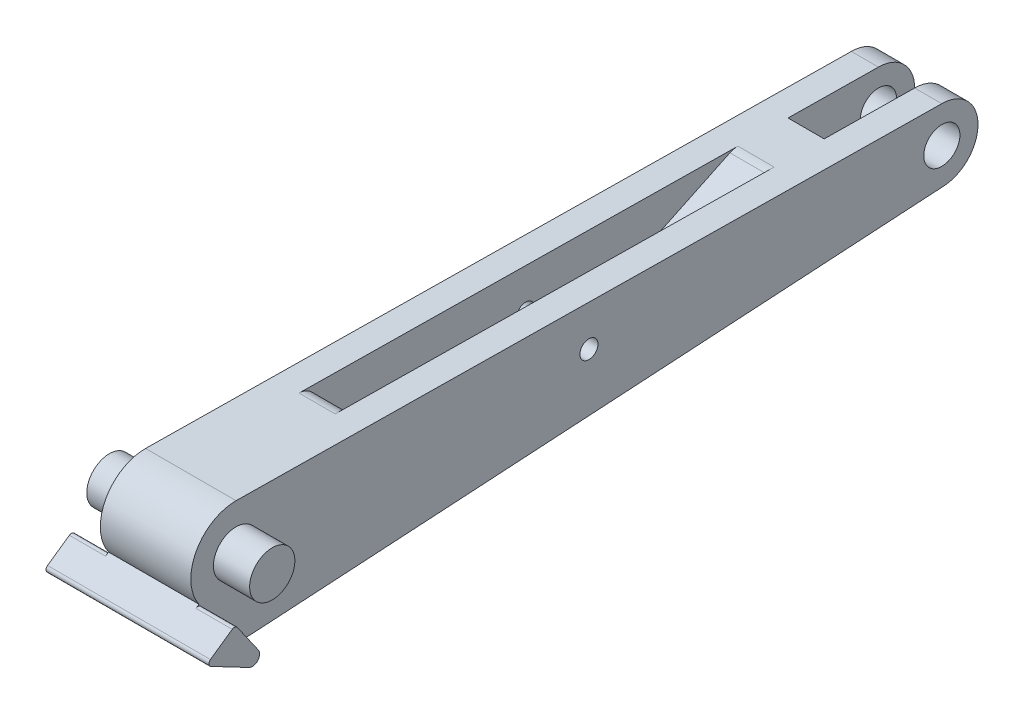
ISO-10303-21;
HEADER;
FILE_DESCRIPTION(('STEP AP214'),'2;1');
FILE_NAME('part.step','',(''),(''),'','','');
FILE_SCHEMA(('AUTOMOTIVE_DESIGN { 1 0 10303 214 1 1 1 1 }'));
ENDSEC;
DATA;
#1=APPLICATION_CONTEXT('core data for automotive mechanical design processes');
#2=APPLICATION_PROTOCOL_DEFINITION('international standard','automotive_design',2000,#1);
#3=PRODUCT_CONTEXT('',#1,'mechanical');
#4=PRODUCT('Part','Part','',(#3));
#5=PRODUCT_RELATED_PRODUCT_CATEGORY('part','',(#4));
#6=PRODUCT_DEFINITION_FORMATION('','',#4);
#7=PRODUCT_DEFINITION_CONTEXT('part definition',#1,'design');
#8=PRODUCT_DEFINITION('design','',#6,#7);
#9=PRODUCT_DEFINITION_SHAPE('','',#8);
#10=(LENGTH_UNIT() NAMED_UNIT(*) SI_UNIT(.MILLI.,.METRE.));
#11=(NAMED_UNIT(*) PLANE_ANGLE_UNIT() SI_UNIT($,.RADIAN.));
#12=(NAMED_UNIT(*) SI_UNIT($,.STERADIAN.) SOLID_ANGLE_UNIT());
#13=UNCERTAINTY_MEASURE_WITH_UNIT(LENGTH_MEASURE(1.E-05),#10,'distance_accuracy_value','');
#14=(GEOMETRIC_REPRESENTATION_CONTEXT(3) GLOBAL_UNCERTAINTY_ASSIGNED_CONTEXT((#13)) GLOBAL_UNIT_ASSIGNED_CONTEXT((#10,
#11,#12)) REPRESENTATION_CONTEXT('',''));
#15=CARTESIAN_POINT('',(0.,0.,0.));
#16=DIRECTION('',(0.,0.,1.));
#17=DIRECTION('',(1.,0.,0.));
#18=AXIS2_PLACEMENT_3D('',#15,#16,#17);
#19=CARTESIAN_POINT('',(125.,-217.353136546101,-13.1488350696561));
#20=DIRECTION('',(0.,0.998175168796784,0.0603848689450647));
#21=DIRECTION('',(0.,-0.0603848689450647,0.998175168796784));
#22=AXIS2_PLACEMENT_3D('',#19,#20,#21);
#23=PLANE('',#22);
#24=DIRECTION('',(0.,0.0603848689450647,-0.998175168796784));
#25=VECTOR('',#24,1.);
#26=CARTESIAN_POINT('',(125.,-217.353136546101,-13.1488350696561));
#27=LINE('',#26,#25);
#28=CARTESIAN_POINT('',(125.,-215.569203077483,-42.6376477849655));
#29=VERTEX_POINT('',#28);
#30=CARTESIAN_POINT('',(125.,-99.8175168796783,-1956.03848689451));
#31=VERTEX_POINT('',#30);
#32=EDGE_CURVE('E325',#29,#31,#27,.T.);
#33=ORIENTED_EDGE('',*,*,#32,.F.);
#34=DIRECTION('',(-1.,0.,0.));
#35=VECTOR('',#34,1.);
#36=CARTESIAN_POINT('',(125.,-215.569203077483,-42.6376477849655));
#37=LINE('',#36,#35);
#38=CARTESIAN_POINT('',(-125.,-215.569203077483,-42.6376477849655));
#39=VERTEX_POINT('',#38);
#40=EDGE_CURVE('E347',#29,#39,#37,.T.);
#41=ORIENTED_EDGE('',*,*,#40,.T.);
#42=DIRECTION('',(0.,0.0603848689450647,-0.998175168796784));
#43=VECTOR('',#42,1.);
#44=CARTESIAN_POINT('',(-125.,-217.353136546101,-13.1488350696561));
#45=LINE('',#44,#43);
#46=CARTESIAN_POINT('',(-125.,-99.8175168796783,-1956.03848689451));
#47=VERTEX_POINT('',#46);
#48=EDGE_CURVE('E324',#39,#47,#45,.T.);
#49=ORIENTED_EDGE('',*,*,#48,.T.);
#50=DIRECTION('',(-1.,0.,0.));
#51=VECTOR('',#50,1.);
#52=CARTESIAN_POINT('',(-50.,-99.8175168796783,-1956.03848689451));
#53=LINE('',#52,#51);
#54=CARTESIAN_POINT('',(-50.,-99.8175168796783,-1956.03848689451));
#55=VERTEX_POINT('',#54);
#56=EDGE_CURVE('E280',#55,#47,#53,.T.);
#57=ORIENTED_EDGE('',*,*,#56,.F.);
#58=DIRECTION('',(0.,0.0603848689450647,-0.998175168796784));
#59=VECTOR('',#58,1.);
#60=CARTESIAN_POINT('',(-50.,-217.353136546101,-13.1488350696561));
#61=LINE('',#60,#59);
#62=CARTESIAN_POINT('',(-50.,-115.306632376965,-1700.));
#63=VERTEX_POINT('',#62);
#64=EDGE_CURVE('E267',#63,#55,#61,.T.);
#65=ORIENTED_EDGE('',*,*,#64,.F.);
#66=DIRECTION('',(-1.,0.,0.));
#67=VECTOR('',#66,1.);
#68=CARTESIAN_POINT('',(125.,-115.306632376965,-1700.));
#69=LINE('',#68,#67);
#70=CARTESIAN_POINT('',(50.,-115.306632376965,-1700.));
#71=VERTEX_POINT('',#70);
#72=EDGE_CURVE('E344',#71,#63,#69,.T.);
#73=ORIENTED_EDGE('',*,*,#72,.F.);
#74=DIRECTION('',(0.,-0.0603848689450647,0.998175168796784));
#75=VECTOR('',#74,1.);
#76=CARTESIAN_POINT('',(50.,-217.353136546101,-13.1488350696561));
#77=LINE('',#76,#75);
#78=CARTESIAN_POINT('',(50.,-99.8175168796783,-1956.03848689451));
#79=VERTEX_POINT('',#78);
#80=EDGE_CURVE('E313',#79,#71,#77,.T.);
#81=ORIENTED_EDGE('',*,*,#80,.F.);
#82=DIRECTION('',(1.,0.,0.));
#83=VECTOR('',#82,1.);
#84=CARTESIAN_POINT('',(50.,-99.8175168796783,-1956.03848689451));
#85=LINE('',#84,#83);
#86=EDGE_CURVE('E316',#79,#31,#85,.T.);
#87=ORIENTED_EDGE('',*,*,#86,.T.);
#88=EDGE_LOOP('',(#33,#41,#49,#57,#65,#73,#81,#87));
#89=FACE_BOUND('',#88,.T.);
#90=DIRECTION('',(1.,0.,0.));
#91=VECTOR('',#90,1.);
#92=CARTESIAN_POINT('',(125.,-190.793043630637,-452.193014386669));
#93=LINE('',#92,#91);
#94=CARTESIAN_POINT('',(-50.,-190.793043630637,-452.193014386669));
#95=VERTEX_POINT('',#94);
#96=CARTESIAN_POINT('',(50.,-190.793043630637,-452.193014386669));
#97=VERTEX_POINT('',#96);
#98=EDGE_CURVE('E439',#95,#97,#93,.T.);
#99=ORIENTED_EDGE('',*,*,#98,.T.);
#100=DIRECTION('',(0.,0.0603848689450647,-0.998175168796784));
#101=VECTOR('',#100,1.);
#102=CARTESIAN_POINT('',(50.,-157.693359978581,-999.338067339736));
#103=LINE('',#102,#101);
#104=CARTESIAN_POINT('',(50.,-142.198562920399,-1255.47047168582));
#105=VERTEX_POINT('',#104);
#106=EDGE_CURVE('E90',#97,#105,#103,.T.);
#107=ORIENTED_EDGE('',*,*,#106,.T.);
#108=DIRECTION('',(1.,0.,0.));
#109=VECTOR('',#108,1.);
#110=CARTESIAN_POINT('',(125.,-142.198562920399,-1255.47047168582));
#111=LINE('',#110,#109);
#112=CARTESIAN_POINT('',(-50.,-142.198562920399,-1255.47047168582));
#113=VERTEX_POINT('',#112);
#114=EDGE_CURVE('E437',#105,#113,#111,.F.);
#115=ORIENTED_EDGE('',*,*,#114,.T.);
#116=DIRECTION('',(0.,0.0603848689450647,-0.998175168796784));
#117=VECTOR('',#116,1.);
#118=CARTESIAN_POINT('',(-50.,-157.693359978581,-999.338067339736));
#119=LINE('',#118,#117);
#120=EDGE_CURVE('E98',#95,#113,#119,.T.);
#121=ORIENTED_EDGE('',*,*,#120,.F.);
#122=EDGE_LOOP('',(#99,#107,#115,#121));
#123=FACE_BOUND('',#122,.T.);
#124=ADVANCED_FACE('F75',(#89,#123),#23,.F.);
#125=CARTESIAN_POINT('',(125.,124.979457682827,-1.60230073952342));
#126=DIRECTION('',(0.,0.999917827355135,-0.0128194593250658));
#127=DIRECTION('',(0.,0.0128194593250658,0.999917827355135));
#128=AXIS2_PLACEMENT_3D('',#125,#126,#127);
#129=PLANE('',#128);
#130=DIRECTION('',(0.,-0.0128194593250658,-0.999917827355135));
#131=VECTOR('',#130,1.);
#132=CARTESIAN_POINT('',(-125.,124.979457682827,-1.60230073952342));
#133=LINE('',#132,#131);
#134=CARTESIAN_POINT('',(-125.,125.,0.));
#135=VERTEX_POINT('',#134);
#136=CARTESIAN_POINT('',(-125.,100.,-1950.));
#137=VERTEX_POINT('',#136);
#138=EDGE_CURVE('E338',#135,#137,#133,.T.);
#139=ORIENTED_EDGE('',*,*,#138,.F.);
#140=DIRECTION('',(-1.,0.,0.));
#141=VECTOR('',#140,1.);
#142=CARTESIAN_POINT('',(125.,125.,0.));
#143=LINE('',#142,#141);
#144=CARTESIAN_POINT('',(125.,125.,0.));
#145=VERTEX_POINT('',#144);
#146=EDGE_CURVE('E336',#145,#135,#143,.T.);
#147=ORIENTED_EDGE('',*,*,#146,.F.);
#148=DIRECTION('',(0.,-0.0128194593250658,-0.999917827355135));
#149=VECTOR('',#148,1.);
#150=CARTESIAN_POINT('',(125.,124.979457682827,-1.60230073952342));
#151=LINE('',#150,#149);
#152=CARTESIAN_POINT('',(125.,100.,-1950.));
#153=VERTEX_POINT('',#152);
#154=EDGE_CURVE('E327',#145,#153,#151,.T.);
#155=ORIENTED_EDGE('',*,*,#154,.T.);
#156=DIRECTION('',(1.,0.,0.));
#157=VECTOR('',#156,1.);
#158=CARTESIAN_POINT('',(50.,100.,-1950.));
#159=LINE('',#158,#157);
#160=CARTESIAN_POINT('',(50.,100.,-1950.));
#161=VERTEX_POINT('',#160);
#162=EDGE_CURVE('E321',#161,#153,#159,.T.);
#163=ORIENTED_EDGE('',*,*,#162,.F.);
#164=DIRECTION('',(0.,0.0128194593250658,0.999917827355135));
#165=VECTOR('',#164,1.);
#166=CARTESIAN_POINT('',(50.,124.979457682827,-1.60230073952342));
#167=LINE('',#166,#165);
#168=CARTESIAN_POINT('',(50.,103.205128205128,-1700.));
#169=VERTEX_POINT('',#168);
#170=EDGE_CURVE('E308',#161,#169,#167,.T.);
#171=ORIENTED_EDGE('',*,*,#170,.T.);
#172=DIRECTION('',(-1.,0.,0.));
#173=VECTOR('',#172,1.);
#174=CARTESIAN_POINT('',(125.,103.205128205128,-1700.));
#175=LINE('',#174,#173);
#176=CARTESIAN_POINT('',(-50.,103.205128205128,-1700.));
#177=VERTEX_POINT('',#176);
#178=EDGE_CURVE('E287',#169,#177,#175,.T.);
#179=ORIENTED_EDGE('',*,*,#178,.T.);
#180=DIRECTION('',(0.,-0.0128194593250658,-0.999917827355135));
#181=VECTOR('',#180,1.);
#182=CARTESIAN_POINT('',(-50.,124.979457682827,-1.60230073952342));
#183=LINE('',#182,#181);
#184=CARTESIAN_POINT('',(-50.,100.,-1950.));
#185=VERTEX_POINT('',#184);
#186=EDGE_CURVE('E264',#177,#185,#183,.T.);
#187=ORIENTED_EDGE('',*,*,#186,.T.);
#188=DIRECTION('',(-1.,0.,0.));
#189=VECTOR('',#188,1.);
#190=CARTESIAN_POINT('',(-50.,100.,-1950.));
#191=LINE('',#190,#189);
#192=EDGE_CURVE('E274',#185,#137,#191,.T.);
#193=ORIENTED_EDGE('',*,*,#192,.T.);
#194=EDGE_LOOP('',(#139,#147,#155,#163,#171,#179,#187,#193));
#195=FACE_BOUND('',#194,.T.);
#196=DIRECTION('',(0.,0.0128194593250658,0.999917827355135));
#197=VECTOR('',#196,1.);
#198=CARTESIAN_POINT('',(50.,120.128205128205,-380.));
#199=LINE('',#198,#197);
#200=CARTESIAN_POINT('',(50.,104.978757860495,-1561.65688688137));
#201=VERTEX_POINT('',#200);
#202=CARTESIAN_POINT('',(50.,120.526796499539,-348.909873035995));
#203=VERTEX_POINT('',#202);
#204=EDGE_CURVE('E468',#201,#203,#199,.T.);
#205=ORIENTED_EDGE('',*,*,#204,.T.);
#206=DIRECTION('',(1.,0.,0.));
#207=VECTOR('',#206,1.);
#208=CARTESIAN_POINT('',(-50.,120.526796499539,-348.909873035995));
#209=LINE('',#208,#207);
#210=CARTESIAN_POINT('',(-50.,120.526796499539,-348.909873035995));
#211=VERTEX_POINT('',#210);
#212=EDGE_CURVE('E429',#203,#211,#209,.F.);
#213=ORIENTED_EDGE('',*,*,#212,.T.);
#214=DIRECTION('',(0.,0.0128194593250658,0.999917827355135));
#215=VECTOR('',#214,1.);
#216=CARTESIAN_POINT('',(-50.,120.128205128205,-380.));
#217=LINE('',#216,#215);
#218=CARTESIAN_POINT('',(-50.,104.978757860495,-1561.65688688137));
#219=VERTEX_POINT('',#218);
#220=EDGE_CURVE('E465',#219,#211,#217,.T.);
#221=ORIENTED_EDGE('',*,*,#220,.F.);
#222=DIRECTION('',(1.,0.,0.));
#223=VECTOR('',#222,1.);
#224=CARTESIAN_POINT('',(50.,104.978757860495,-1561.65688688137));
#225=LINE('',#224,#223);
#226=EDGE_CURVE('E426',#219,#201,#225,.T.);
#227=ORIENTED_EDGE('',*,*,#226,.T.);
#228=EDGE_LOOP('',(#205,#213,#221,#227));
#229=FACE_BOUND('',#228,.T.);
#230=ADVANCED_FACE('F284',(#195,#229),#129,.T.);
#231=CARTESIAN_POINT('',(125.,0.,0.));
#232=DIRECTION('',(1.,0.,0.));
#233=DIRECTION('',(0.,0.,-1.));
#234=AXIS2_PLACEMENT_3D('',#231,#232,#233);
#235=PLANE('',#234);
#236=CARTESIAN_POINT('',(125.,0.,-975.));
#237=DIRECTION('',(1.,0.,0.));
#238=DIRECTION('',(0.,0.,-1.));
#239=AXIS2_PLACEMENT_3D('',#236,#237,#238);
#240=CIRCLE('',#239,25.);
#241=CARTESIAN_POINT('',(125.,0.,-1000.));
#242=VERTEX_POINT('',#241);
#243=EDGE_CURVE('E595',#242,#242,#240,.T.);
#244=ORIENTED_EDGE('',*,*,#243,.F.);
#245=EDGE_LOOP('',(#244));
#246=FACE_BOUND('',#245,.T.);
#247=CARTESIAN_POINT('',(125.,0.,0.));
#248=DIRECTION('',(1.,0.,0.));
#249=DIRECTION('',(0.,0.,-1.));
#250=AXIS2_PLACEMENT_3D('',#247,#248,#249);
#251=CIRCLE('',#250,62.5);
#252=CARTESIAN_POINT('',(125.,0.,-62.5));
#253=VERTEX_POINT('',#252);
#254=EDGE_CURVE('E333',#253,#253,#251,.T.);
#255=ORIENTED_EDGE('',*,*,#254,.F.);
#256=EDGE_LOOP('',(#255));
#257=FACE_BOUND('',#256,.T.);
#258=CARTESIAN_POINT('',(125.,0.,-1950.));
#259=DIRECTION('',(1.,0.,0.));
#260=DIRECTION('',(0.,0.,-1.));
#261=AXIS2_PLACEMENT_3D('',#258,#259,#260);
#262=CIRCLE('',#261,50.);
#263=CARTESIAN_POINT('',(125.,0.,-2000.));
#264=VERTEX_POINT('',#263);
#265=EDGE_CURVE('E297',#264,#264,#262,.T.);
#266=ORIENTED_EDGE('',*,*,#265,.F.);
#267=EDGE_LOOP('',(#266));
#268=FACE_BOUND('',#267,.T.);
#269=CARTESIAN_POINT('',(125.,0.,0.));
#270=DIRECTION('',(1.,0.,0.));
#271=DIRECTION('',(0.,0.,-1.));
#272=AXIS2_PLACEMENT_3D('',#269,#270,#271);
#273=CIRCLE('',#272,125.);
#274=CARTESIAN_POINT('',(125.,-71.6970545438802,102.394005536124));
#275=VERTEX_POINT('',#274);
#276=EDGE_CURVE('E330',#145,#275,#273,.T.);
#277=ORIENTED_EDGE('',*,*,#276,.T.);
#278=DIRECTION('',(0.,0.573576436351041,-0.819152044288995));
#279=VECTOR('',#278,1.);
#280=CARTESIAN_POINT('',(125.,0.,0.));
#281=LINE('',#280,#279);
#282=CARTESIAN_POINT('',(125.,-77.4328189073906,110.585525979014));
#283=VERTEX_POINT('',#282);
#284=EDGE_CURVE('E385',#283,#275,#281,.T.);
#285=ORIENTED_EDGE('',*,*,#284,.F.);
#286=CARTESIAN_POINT('',(125.,-85.6243393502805,104.849761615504));
#287=DIRECTION('',(1.,0.,0.));
#288=DIRECTION('',(0.,0.,-1.));
#289=AXIS2_PLACEMENT_3D('',#286,#287,#288);
#290=CIRCLE('',#289,10.);
#291=CARTESIAN_POINT('',(125.,-79.8885749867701,96.658241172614));
#292=VERTEX_POINT('',#291);
#293=EDGE_CURVE('E415',#283,#292,#290,.F.);
#294=ORIENTED_EDGE('',*,*,#293,.T.);
#295=DIRECTION('',(0.,-0.819152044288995,-0.573576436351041));
#296=VECTOR('',#295,1.);
#297=CARTESIAN_POINT('',(125.,-71.6970545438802,102.394005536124));
#298=LINE('',#297,#296);
#299=CARTESIAN_POINT('',(125.,-162.87847629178,38.5480866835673));
#300=VERTEX_POINT('',#299);
#301=EDGE_CURVE('E491',#292,#300,#298,.T.);
#302=ORIENTED_EDGE('',*,*,#301,.T.);
#303=CARTESIAN_POINT('',(125.,-174.3500050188,54.9311275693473));
#304=DIRECTION('',(1.,0.,0.));
#305=DIRECTION('',(0.,0.,-1.));
#306=AXIS2_PLACEMENT_3D('',#303,#304,#305);
#307=CIRCLE('',#306,20.);
#308=CARTESIAN_POINT('',(125.,-192.060358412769,64.2232415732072));
#309=VERTEX_POINT('',#308);
#310=EDGE_CURVE('E383',#300,#309,#307,.F.);
#311=ORIENTED_EDGE('',*,*,#310,.T.);
#312=DIRECTION('',(0.,0.464605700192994,0.885517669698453));
#313=VECTOR('',#312,1.);
#314=CARTESIAN_POINT('',(125.,-177.025010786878,92.8799411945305));
#315=LINE('',#314,#313);
#316=CARTESIAN_POINT('',(125.,-193.037703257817,62.3604660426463));
#317=VERTEX_POINT('',#316);
#318=EDGE_CURVE('E366',#317,#309,#315,.T.);
#319=ORIENTED_EDGE('',*,*,#318,.F.);
#320=CARTESIAN_POINT('',(125.,-15.9341693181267,-30.5606739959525));
#321=DIRECTION('',(1.,0.,0.));
#322=DIRECTION('',(0.,0.,-1.));
#323=AXIS2_PLACEMENT_3D('',#320,#321,#322);
#324=CIRCLE('',#323,200.);
#325=EDGE_CURVE('E355',#317,#29,#324,.T.);
#326=ORIENTED_EDGE('',*,*,#325,.T.);
#327=ORIENTED_EDGE('',*,*,#32,.T.);
#328=CARTESIAN_POINT('',(125.,0.,-1950.));
#329=DIRECTION('',(1.,0.,0.));
#330=DIRECTION('',(0.,0.,-1.));
#331=AXIS2_PLACEMENT_3D('',#328,#329,#330);
#332=CIRCLE('',#331,100.);
#333=EDGE_CURVE('E302',#31,#153,#332,.T.);
#334=ORIENTED_EDGE('',*,*,#333,.T.);
#335=ORIENTED_EDGE('',*,*,#154,.F.);
#336=EDGE_LOOP('',(#277,#285,#294,#302,#311,#319,#326,#327,#334,#335));
#337=FACE_BOUND('',#336,.T.);
#338=ADVANCED_FACE('F533',(#246,#257,#268,#337),#235,.T.);
#339=CARTESIAN_POINT('',(-125.,0.,0.));
#340=DIRECTION('',(1.,0.,0.));
#341=DIRECTION('',(0.,0.,-1.));
#342=AXIS2_PLACEMENT_3D('',#339,#340,#341);
#343=PLANE('',#342);
#344=CARTESIAN_POINT('',(-125.,0.,-975.));
#345=DIRECTION('',(1.,0.,0.));
#346=DIRECTION('',(0.,0.,-1.));
#347=AXIS2_PLACEMENT_3D('',#344,#345,#346);
#348=CIRCLE('',#347,25.);
#349=CARTESIAN_POINT('',(-125.,0.,-1000.));
#350=VERTEX_POINT('',#349);
#351=EDGE_CURVE('E597',#350,#350,#348,.T.);
#352=ORIENTED_EDGE('',*,*,#351,.T.);
#353=EDGE_LOOP('',(#352));
#354=FACE_BOUND('',#353,.T.);
#355=CARTESIAN_POINT('',(-125.,0.,-1950.));
#356=DIRECTION('',(1.,0.,0.));
#357=DIRECTION('',(0.,0.,-1.));
#358=AXIS2_PLACEMENT_3D('',#355,#356,#357);
#359=CIRCLE('',#358,50.);
#360=CARTESIAN_POINT('',(-125.,0.,-2000.));
#361=VERTEX_POINT('',#360);
#362=EDGE_CURVE('E292',#361,#361,#359,.T.);
#363=ORIENTED_EDGE('',*,*,#362,.T.);
#364=EDGE_LOOP('',(#363));
#365=FACE_BOUND('',#364,.T.);
#366=CARTESIAN_POINT('',(-125.,0.,0.));
#367=DIRECTION('',(1.,0.,0.));
#368=DIRECTION('',(0.,0.,-1.));
#369=AXIS2_PLACEMENT_3D('',#366,#367,#368);
#370=CIRCLE('',#369,62.5);
#371=CARTESIAN_POINT('',(-125.,0.,-62.5));
#372=VERTEX_POINT('',#371);
#373=EDGE_CURVE('E500',#372,#372,#370,.F.);
#374=ORIENTED_EDGE('',*,*,#373,.F.);
#375=EDGE_LOOP('',(#374));
#376=FACE_BOUND('',#375,.T.);
#377=ORIENTED_EDGE('',*,*,#48,.F.);
#378=CARTESIAN_POINT('',(-125.,-15.9341693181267,-30.5606739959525));
#379=DIRECTION('',(1.,0.,0.));
#380=DIRECTION('',(0.,0.,-1.));
#381=AXIS2_PLACEMENT_3D('',#378,#379,#380);
#382=CIRCLE('',#381,200.);
#383=CARTESIAN_POINT('',(-125.,-193.037703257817,62.3604660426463));
#384=VERTEX_POINT('',#383);
#385=EDGE_CURVE('E350',#39,#384,#382,.F.);
#386=ORIENTED_EDGE('',*,*,#385,.T.);
#387=DIRECTION('',(0.,-0.464605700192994,-0.885517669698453));
#388=VECTOR('',#387,1.);
#389=CARTESIAN_POINT('',(-125.,-129.054698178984,184.309209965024));
#390=LINE('',#389,#388);
#391=CARTESIAN_POINT('',(-125.,-192.060358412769,64.2232415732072));
#392=VERTEX_POINT('',#391);
#393=EDGE_CURVE('E369',#392,#384,#390,.T.);
#394=ORIENTED_EDGE('',*,*,#393,.F.);
#395=CARTESIAN_POINT('',(-125.,-174.3500050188,54.9311275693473));
#396=DIRECTION('',(1.,0.,0.));
#397=DIRECTION('',(0.,0.,-1.));
#398=AXIS2_PLACEMENT_3D('',#395,#396,#397);
#399=CIRCLE('',#398,20.);
#400=CARTESIAN_POINT('',(-125.,-162.87847629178,38.5480866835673));
#401=VERTEX_POINT('',#400);
#402=EDGE_CURVE('E380',#392,#401,#399,.T.);
#403=ORIENTED_EDGE('',*,*,#402,.T.);
#404=DIRECTION('',(0.,-0.819152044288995,-0.573576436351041));
#405=VECTOR('',#404,1.);
#406=CARTESIAN_POINT('',(-125.,-71.6970545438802,102.394005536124));
#407=LINE('',#406,#405);
#408=CARTESIAN_POINT('',(-125.,-79.8885749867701,96.658241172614));
#409=VERTEX_POINT('',#408);
#410=EDGE_CURVE('E481',#409,#401,#407,.T.);
#411=ORIENTED_EDGE('',*,*,#410,.F.);
#412=CARTESIAN_POINT('',(-125.,-85.6243393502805,104.849761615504));
#413=DIRECTION('',(1.,0.,0.));
#414=DIRECTION('',(0.,0.,-1.));
#415=AXIS2_PLACEMENT_3D('',#412,#413,#414);
#416=CIRCLE('',#415,10.);
#417=CARTESIAN_POINT('',(-125.,-77.4328189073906,110.585525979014));
#418=VERTEX_POINT('',#417);
#419=EDGE_CURVE('E413',#409,#418,#416,.T.);
#420=ORIENTED_EDGE('',*,*,#419,.T.);
#421=DIRECTION('',(0.,-0.573576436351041,0.819152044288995));
#422=VECTOR('',#421,1.);
#423=CARTESIAN_POINT('',(-125.,-71.6970545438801,102.394005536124));
#424=LINE('',#423,#422);
#425=CARTESIAN_POINT('',(-125.,-71.6970545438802,102.394005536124));
#426=VERTEX_POINT('',#425);
#427=EDGE_CURVE('E392',#426,#418,#424,.T.);
#428=ORIENTED_EDGE('',*,*,#427,.F.);
#429=CARTESIAN_POINT('',(-125.,0.,0.));
#430=DIRECTION('',(1.,0.,0.));
#431=DIRECTION('',(0.,0.,-1.));
#432=AXIS2_PLACEMENT_3D('',#429,#430,#431);
#433=CIRCLE('',#432,125.);
#434=EDGE_CURVE('E328',#135,#426,#433,.T.);
#435=ORIENTED_EDGE('',*,*,#434,.F.);
#436=ORIENTED_EDGE('',*,*,#138,.T.);
#437=CARTESIAN_POINT('',(-125.,0.,-1950.));
#438=DIRECTION('',(1.,0.,0.));
#439=DIRECTION('',(0.,0.,-1.));
#440=AXIS2_PLACEMENT_3D('',#437,#438,#439);
#441=CIRCLE('',#440,100.);
#442=EDGE_CURVE('E277',#47,#137,#441,.T.);
#443=ORIENTED_EDGE('',*,*,#442,.F.);
#444=EDGE_LOOP('',(#377,#386,#394,#403,#411,#420,#428,#435,#436,#443));
#445=FACE_BOUND('',#444,.T.);
#446=ADVANCED_FACE('F510',(#354,#365,#376,#445),#343,.F.);
#447=CARTESIAN_POINT('',(125.,0.,0.));
#448=DIRECTION('',(-1.,0.,0.));
#449=DIRECTION('',(0.,0.,1.));
#450=AXIS2_PLACEMENT_3D('',#447,#448,#449);
#451=CYLINDRICAL_SURFACE('',#450,125.);
#452=DIRECTION('',(-1.,0.,0.));
#453=VECTOR('',#452,1.);
#454=CARTESIAN_POINT('',(125.,-71.6970545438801,102.394005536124));
#455=LINE('',#454,#453);
#456=EDGE_CURVE('E493',#275,#426,#455,.T.);
#457=ORIENTED_EDGE('',*,*,#456,.F.);
#458=ORIENTED_EDGE('',*,*,#276,.F.);
#459=ORIENTED_EDGE('',*,*,#146,.T.);
#460=ORIENTED_EDGE('',*,*,#434,.T.);
#461=EDGE_LOOP('',(#457,#458,#459,#460));
#462=FACE_BOUND('',#461,.T.);
#463=ADVANCED_FACE('F669',(#462),#451,.T.);
#464=CARTESIAN_POINT('',(125.,0.,-1700.));
#465=DIRECTION('',(0.,0.,-1.));
#466=DIRECTION('',(-1.,0.,0.));
#467=AXIS2_PLACEMENT_3D('',#464,#465,#466);
#468=PLANE('',#467);
#469=DIRECTION('',(0.,-1.,0.));
#470=VECTOR('',#469,1.);
#471=CARTESIAN_POINT('',(-50.,0.,-1700.));
#472=LINE('',#471,#470);
#473=EDGE_CURVE('E281',#177,#63,#472,.T.);
#474=ORIENTED_EDGE('',*,*,#473,.F.);
#475=ORIENTED_EDGE('',*,*,#178,.F.);
#476=DIRECTION('',(0.,1.,0.));
#477=VECTOR('',#476,1.);
#478=CARTESIAN_POINT('',(50.,0.,-1700.));
#479=LINE('',#478,#477);
#480=EDGE_CURVE('E305',#71,#169,#479,.T.);
#481=ORIENTED_EDGE('',*,*,#480,.F.);
#482=ORIENTED_EDGE('',*,*,#72,.T.);
#483=EDGE_LOOP('',(#474,#475,#481,#482));
#484=FACE_BOUND('',#483,.T.);
#485=ADVANCED_FACE('F538',(#484),#468,.T.);
#486=CARTESIAN_POINT('',(50.,0.,-1950.));
#487=DIRECTION('',(1.,0.,0.));
#488=DIRECTION('',(0.,0.,-1.));
#489=AXIS2_PLACEMENT_3D('',#486,#487,#488);
#490=CYLINDRICAL_SURFACE('',#489,100.);
#491=ORIENTED_EDGE('',*,*,#333,.F.);
#492=ORIENTED_EDGE('',*,*,#86,.F.);
#493=CARTESIAN_POINT('',(50.,0.,-1950.));
#494=DIRECTION('',(1.,0.,0.));
#495=DIRECTION('',(0.,0.,-1.));
#496=AXIS2_PLACEMENT_3D('',#493,#494,#495);
#497=CIRCLE('',#496,100.);
#498=EDGE_CURVE('E310',#79,#161,#497,.T.);
#499=ORIENTED_EDGE('',*,*,#498,.T.);
#500=ORIENTED_EDGE('',*,*,#162,.T.);
#501=EDGE_LOOP('',(#491,#492,#499,#500));
#502=FACE_BOUND('',#501,.T.);
#503=ADVANCED_FACE('F692',(#502),#490,.T.);
#504=CARTESIAN_POINT('',(50.,0.,-1950.));
#505=DIRECTION('',(1.,0.,0.));
#506=DIRECTION('',(0.,0.,-1.));
#507=AXIS2_PLACEMENT_3D('',#504,#505,#506);
#508=PLANE('',#507);
#509=CARTESIAN_POINT('',(50.,0.,-1950.));
#510=DIRECTION('',(1.,0.,0.));
#511=DIRECTION('',(0.,0.,-1.));
#512=AXIS2_PLACEMENT_3D('',#509,#510,#511);
#513=CIRCLE('',#512,50.);
#514=CARTESIAN_POINT('',(50.,0.,-2000.));
#515=VERTEX_POINT('',#514);
#516=EDGE_CURVE('E299',#515,#515,#513,.T.);
#517=ORIENTED_EDGE('',*,*,#516,.T.);
#518=EDGE_LOOP('',(#517));
#519=FACE_BOUND('',#518,.T.);
#520=ORIENTED_EDGE('',*,*,#480,.T.);
#521=ORIENTED_EDGE('',*,*,#170,.F.);
#522=ORIENTED_EDGE('',*,*,#498,.F.);
#523=ORIENTED_EDGE('',*,*,#80,.T.);
#524=EDGE_LOOP('',(#520,#521,#522,#523));
#525=FACE_BOUND('',#524,.T.);
#526=ADVANCED_FACE('F695',(#519,#525),#508,.F.);
#527=CARTESIAN_POINT('',(50.,0.,-1950.));
#528=DIRECTION('',(1.,0.,0.));
#529=DIRECTION('',(0.,0.,-1.));
#530=AXIS2_PLACEMENT_3D('',#527,#528,#529);
#531=CYLINDRICAL_SURFACE('',#530,50.);
#532=ORIENTED_EDGE('',*,*,#516,.F.);
#533=EDGE_LOOP('',(#532));
#534=FACE_BOUND('',#533,.T.);
#535=ORIENTED_EDGE('',*,*,#265,.T.);
#536=EDGE_LOOP('',(#535));
#537=FACE_BOUND('',#536,.T.);
#538=ADVANCED_FACE('F964',(#534,#537),#531,.F.);
#539=CARTESIAN_POINT('',(-50.,0.,-1950.));
#540=DIRECTION('',(1.,0.,0.));
#541=DIRECTION('',(0.,0.,-1.));
#542=AXIS2_PLACEMENT_3D('',#539,#540,#541);
#543=PLANE('',#542);
#544=ORIENTED_EDGE('',*,*,#186,.F.);
#545=ORIENTED_EDGE('',*,*,#473,.T.);
#546=ORIENTED_EDGE('',*,*,#64,.T.);
#547=CARTESIAN_POINT('',(-50.,0.,-1950.));
#548=DIRECTION('',(1.,0.,0.));
#549=DIRECTION('',(0.,0.,-1.));
#550=AXIS2_PLACEMENT_3D('',#547,#548,#549);
#551=CIRCLE('',#550,100.);
#552=EDGE_CURVE('E259',#55,#185,#551,.T.);
#553=ORIENTED_EDGE('',*,*,#552,.T.);
#554=EDGE_LOOP('',(#544,#545,#546,#553));
#555=FACE_BOUND('',#554,.T.);
#556=CARTESIAN_POINT('',(-50.,0.,-1950.));
#557=DIRECTION('',(1.,0.,0.));
#558=DIRECTION('',(0.,0.,-1.));
#559=AXIS2_PLACEMENT_3D('',#556,#557,#558);
#560=CIRCLE('',#559,50.);
#561=CARTESIAN_POINT('',(-50.,0.,-2000.));
#562=VERTEX_POINT('',#561);
#563=EDGE_CURVE('E289',#562,#562,#560,.T.);
#564=ORIENTED_EDGE('',*,*,#563,.F.);
#565=EDGE_LOOP('',(#564));
#566=FACE_BOUND('',#565,.T.);
#567=ADVANCED_FACE('F261',(#555,#566),#543,.T.);
#568=CARTESIAN_POINT('',(-50.,0.,-1950.));
#569=DIRECTION('',(-1.,0.,0.));
#570=DIRECTION('',(0.,0.,1.));
#571=AXIS2_PLACEMENT_3D('',#568,#569,#570);
#572=CYLINDRICAL_SURFACE('',#571,100.);
#573=ORIENTED_EDGE('',*,*,#442,.T.);
#574=ORIENTED_EDGE('',*,*,#192,.F.);
#575=ORIENTED_EDGE('',*,*,#552,.F.);
#576=ORIENTED_EDGE('',*,*,#56,.T.);
#577=EDGE_LOOP('',(#573,#574,#575,#576));
#578=FACE_BOUND('',#577,.T.);
#579=ADVANCED_FACE('F275',(#578),#572,.T.);
#580=CARTESIAN_POINT('',(-50.,0.,-1950.));
#581=DIRECTION('',(-1.,0.,0.));
#582=DIRECTION('',(0.,0.,1.));
#583=AXIS2_PLACEMENT_3D('',#580,#581,#582);
#584=CYLINDRICAL_SURFACE('',#583,50.);
#585=ORIENTED_EDGE('',*,*,#563,.T.);
#586=EDGE_LOOP('',(#585));
#587=FACE_BOUND('',#586,.T.);
#588=ORIENTED_EDGE('',*,*,#362,.F.);
#589=EDGE_LOOP('',(#588));
#590=FACE_BOUND('',#589,.T.);
#591=ADVANCED_FACE('F513',(#587,#590),#584,.F.);
#592=CARTESIAN_POINT('',(-225.,0.,0.));
#593=DIRECTION('',(1.,0.,0.));
#594=DIRECTION('',(0.,0.,-1.));
#595=AXIS2_PLACEMENT_3D('',#592,#593,#594);
#596=PLANE('',#595);
#597=CARTESIAN_POINT('',(-225.,0.,0.));
#598=DIRECTION('',(1.,0.,0.));
#599=DIRECTION('',(0.,0.,-1.));
#600=AXIS2_PLACEMENT_3D('',#597,#598,#599);
#601=CIRCLE('',#600,62.5);
#602=CARTESIAN_POINT('',(-225.,0.,-62.5));
#603=VERTEX_POINT('',#602);
#604=EDGE_CURVE('E496',#603,#603,#601,.T.);
#605=ORIENTED_EDGE('',*,*,#604,.F.);
#606=EDGE_LOOP('',(#605));
#607=FACE_BOUND('',#606,.T.);
#608=ADVANCED_FACE('F515',(#607),#596,.F.);
#609=CARTESIAN_POINT('',(225.,0.,0.));
#610=DIRECTION('',(-1.,0.,0.));
#611=DIRECTION('',(0.,0.,1.));
#612=AXIS2_PLACEMENT_3D('',#609,#610,#611);
#613=CYLINDRICAL_SURFACE('',#612,62.5);
#614=ORIENTED_EDGE('',*,*,#604,.T.);
#615=EDGE_LOOP('',(#614));
#616=FACE_BOUND('',#615,.T.);
#617=ORIENTED_EDGE('',*,*,#373,.T.);
#618=EDGE_LOOP('',(#617));
#619=FACE_BOUND('',#618,.T.);
#620=ADVANCED_FACE('F521',(#616,#619),#613,.T.);
#621=ORIENTED_EDGE('',*,*,#254,.T.);
#622=EDGE_LOOP('',(#621));
#623=FACE_BOUND('',#622,.T.);
#624=CARTESIAN_POINT('',(225.,0.,0.));
#625=DIRECTION('',(1.,0.,0.));
#626=DIRECTION('',(0.,0.,-1.));
#627=AXIS2_PLACEMENT_3D('',#624,#625,#626);
#628=CIRCLE('',#627,62.5);
#629=CARTESIAN_POINT('',(225.,0.,-62.5));
#630=VERTEX_POINT('',#629);
#631=EDGE_CURVE('E497',#630,#630,#628,.T.);
#632=ORIENTED_EDGE('',*,*,#631,.F.);
#633=EDGE_LOOP('',(#632));
#634=FACE_BOUND('',#633,.T.);
#635=ADVANCED_FACE('F646',(#623,#634),#613,.T.);
#636=CARTESIAN_POINT('',(225.,0.,0.));
#637=DIRECTION('',(1.,0.,0.));
#638=DIRECTION('',(0.,0.,-1.));
#639=AXIS2_PLACEMENT_3D('',#636,#637,#638);
#640=PLANE('',#639);
#641=ORIENTED_EDGE('',*,*,#631,.T.);
#642=EDGE_LOOP('',(#641));
#643=FACE_BOUND('',#642,.T.);
#644=ADVANCED_FACE('F643',(#643),#640,.T.);
#645=CARTESIAN_POINT('',(125.,-71.6970545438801,102.394005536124));
#646=DIRECTION('',(0.,-0.819152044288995,-0.573576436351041));
#647=DIRECTION('',(0.,0.573576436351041,-0.819152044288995));
#648=AXIS2_PLACEMENT_3D('',#645,#646,#647);
#649=PLANE('',#648);
#650=ORIENTED_EDGE('',*,*,#427,.T.);
#651=DIRECTION('',(-1.,0.,0.));
#652=VECTOR('',#651,1.);
#653=CARTESIAN_POINT('',(125.,-77.4328189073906,110.585525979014));
#654=LINE('',#653,#652);
#655=CARTESIAN_POINT('',(-225.,-77.4328189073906,110.585525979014));
#656=VERTEX_POINT('',#655);
#657=EDGE_CURVE('E395',#418,#656,#654,.T.);
#658=ORIENTED_EDGE('',*,*,#657,.T.);
#659=DIRECTION('',(0.,-0.573576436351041,0.819152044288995));
#660=VECTOR('',#659,1.);
#661=CARTESIAN_POINT('',(-225.,-129.054698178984,184.309209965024));
#662=LINE('',#661,#660);
#663=CARTESIAN_POINT('',(-225.,-119.636713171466,170.85893344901));
#664=VERTEX_POINT('',#663);
#665=EDGE_CURVE('E475',#656,#664,#662,.T.);
#666=ORIENTED_EDGE('',*,*,#665,.T.);
#667=DIRECTION('',(-1.,0.,0.));
#668=VECTOR('',#667,1.);
#669=CARTESIAN_POINT('',(125.,-119.636713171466,170.85893344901));
#670=LINE('',#669,#668);
#671=CARTESIAN_POINT('',(225.,-119.636713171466,170.85893344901));
#672=VERTEX_POINT('',#671);
#673=EDGE_CURVE('E390',#664,#672,#670,.F.);
#674=ORIENTED_EDGE('',*,*,#673,.T.);
#675=DIRECTION('',(0.,-0.573576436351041,0.819152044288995));
#676=VECTOR('',#675,1.);
#677=CARTESIAN_POINT('',(225.,-129.054698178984,184.309209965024));
#678=LINE('',#677,#676);
#679=CARTESIAN_POINT('',(225.,-77.4328189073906,110.585525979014));
#680=VERTEX_POINT('',#679);
#681=EDGE_CURVE('E478',#680,#672,#678,.T.);
#682=ORIENTED_EDGE('',*,*,#681,.F.);
#683=DIRECTION('',(-1.,0.,0.));
#684=VECTOR('',#683,1.);
#685=CARTESIAN_POINT('',(125.,-77.4328189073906,110.585525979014));
#686=LINE('',#685,#684);
#687=EDGE_CURVE('E387',#680,#283,#686,.T.);
#688=ORIENTED_EDGE('',*,*,#687,.T.);
#689=ORIENTED_EDGE('',*,*,#284,.T.);
#690=ORIENTED_EDGE('',*,*,#456,.T.);
#691=EDGE_LOOP('',(#650,#658,#666,#674,#682,#688,#689,#690));
#692=FACE_BOUND('',#691,.T.);
#693=ADVANCED_FACE('F639',(#692),#649,.F.);
#694=CARTESIAN_POINT('',(125.,-129.054698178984,184.309209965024));
#695=DIRECTION('',(0.,0.885517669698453,-0.464605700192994));
#696=DIRECTION('',(0.,0.464605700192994,0.885517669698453));
#697=AXIS2_PLACEMENT_3D('',#694,#695,#696);
#698=PLANE('',#697);
#699=DIRECTION('',(0.,-0.464605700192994,-0.885517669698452));
#700=VECTOR('',#699,1.);
#701=CARTESIAN_POINT('',(225.,-218.93509013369,13.0012057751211));
#702=LINE('',#701,#700);
#703=CARTESIAN_POINT('',(225.,-136.683410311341,169.769226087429));
#704=VERTEX_POINT('',#703);
#705=CARTESIAN_POINT('',(225.,-192.060358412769,64.2232415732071));
#706=VERTEX_POINT('',#705);
#707=EDGE_CURVE('E472',#704,#706,#702,.T.);
#708=ORIENTED_EDGE('',*,*,#707,.F.);
#709=DIRECTION('',(-1.,0.,0.));
#710=VECTOR('',#709,1.);
#711=CARTESIAN_POINT('',(125.,-136.683410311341,169.769226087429));
#712=LINE('',#711,#710);
#713=CARTESIAN_POINT('',(-225.,-136.683410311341,169.769226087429));
#714=VERTEX_POINT('',#713);
#715=EDGE_CURVE('E404',#704,#714,#712,.T.);
#716=ORIENTED_EDGE('',*,*,#715,.T.);
#717=DIRECTION('',(0.,-0.464605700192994,-0.885517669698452));
#718=VECTOR('',#717,1.);
#719=CARTESIAN_POINT('',(-225.,-218.93509013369,13.0012057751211));
#720=LINE('',#719,#718);
#721=CARTESIAN_POINT('',(-225.,-192.060358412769,64.2232415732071));
#722=VERTEX_POINT('',#721);
#723=EDGE_CURVE('E482',#714,#722,#720,.T.);
#724=ORIENTED_EDGE('',*,*,#723,.T.);
#725=DIRECTION('',(-1.,0.,0.));
#726=VECTOR('',#725,1.);
#727=CARTESIAN_POINT('',(125.,-192.060358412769,64.2232415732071));
#728=LINE('',#727,#726);
#729=EDGE_CURVE('E372',#722,#392,#728,.F.);
#730=ORIENTED_EDGE('',*,*,#729,.T.);
#731=ORIENTED_EDGE('',*,*,#393,.T.);
#732=DIRECTION('',(-1.,0.,0.));
#733=VECTOR('',#732,1.);
#734=CARTESIAN_POINT('',(125.,-193.037703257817,62.3604660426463));
#735=LINE('',#734,#733);
#736=EDGE_CURVE('E352',#384,#317,#735,.F.);
#737=ORIENTED_EDGE('',*,*,#736,.T.);
#738=ORIENTED_EDGE('',*,*,#318,.T.);
#739=DIRECTION('',(-1.,0.,0.));
#740=VECTOR('',#739,1.);
#741=CARTESIAN_POINT('',(125.,-192.060358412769,64.2232415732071));
#742=LINE('',#741,#740);
#743=EDGE_CURVE('E363',#309,#706,#742,.F.);
#744=ORIENTED_EDGE('',*,*,#743,.T.);
#745=EDGE_LOOP('',(#708,#716,#724,#730,#731,#737,#738,#744));
#746=FACE_BOUND('',#745,.T.);
#747=ADVANCED_FACE('F632',(#746),#698,.F.);
#748=CARTESIAN_POINT('',(-225.,0.,0.));
#749=DIRECTION('',(-1.,0.,0.));
#750=DIRECTION('',(0.,0.,1.));
#751=AXIS2_PLACEMENT_3D('',#748,#749,#750);
#752=PLANE('',#751);
#753=ORIENTED_EDGE('',*,*,#665,.F.);
#754=CARTESIAN_POINT('',(-225.,-85.6243393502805,104.849761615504));
#755=DIRECTION('',(-1.,0.,0.));
#756=DIRECTION('',(0.,0.,1.));
#757=AXIS2_PLACEMENT_3D('',#754,#755,#756);
#758=CIRCLE('',#757,10.);
#759=CARTESIAN_POINT('',(-225.,-79.8885749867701,96.658241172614));
#760=VERTEX_POINT('',#759);
#761=EDGE_CURVE('E400',#656,#760,#758,.T.);
#762=ORIENTED_EDGE('',*,*,#761,.T.);
#763=DIRECTION('',(0.,0.819152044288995,0.573576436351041));
#764=VECTOR('',#763,1.);
#765=CARTESIAN_POINT('',(-225.,-71.6970545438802,102.394005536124));
#766=LINE('',#765,#764);
#767=CARTESIAN_POINT('',(-225.,-162.878476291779,38.5480866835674));
#768=VERTEX_POINT('',#767);
#769=EDGE_CURVE('E484',#768,#760,#766,.T.);
#770=ORIENTED_EDGE('',*,*,#769,.F.);
#771=CARTESIAN_POINT('',(-225.,-174.3500050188,54.9311275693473));
#772=DIRECTION('',(-1.,0.,0.));
#773=DIRECTION('',(0.,0.,1.));
#774=AXIS2_PLACEMENT_3D('',#771,#772,#773);
#775=CIRCLE('',#774,20.);
#776=EDGE_CURVE('E360',#768,#722,#775,.T.);
#777=ORIENTED_EDGE('',*,*,#776,.T.);
#778=ORIENTED_EDGE('',*,*,#723,.F.);
#779=CARTESIAN_POINT('',(-225.,-127.828233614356,165.123169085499));
#780=DIRECTION('',(-1.,0.,0.));
#781=DIRECTION('',(0.,0.,1.));
#782=AXIS2_PLACEMENT_3D('',#779,#780,#781);
#783=CIRCLE('',#782,10.);
#784=EDGE_CURVE('E398',#714,#664,#783,.T.);
#785=ORIENTED_EDGE('',*,*,#784,.T.);
#786=EDGE_LOOP('',(#753,#762,#770,#777,#778,#785));
#787=FACE_BOUND('',#786,.T.);
#788=ADVANCED_FACE('F628',(#787),#752,.T.);
#789=CARTESIAN_POINT('',(225.,-71.6970545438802,102.394005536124));
#790=DIRECTION('',(0.,-0.573576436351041,0.819152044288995));
#791=DIRECTION('',(0.,-0.819152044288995,-0.573576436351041));
#792=AXIS2_PLACEMENT_3D('',#789,#790,#791);
#793=PLANE('',#792);
#794=ORIENTED_EDGE('',*,*,#769,.T.);
#795=DIRECTION('',(-1.,0.,0.));
#796=VECTOR('',#795,1.);
#797=CARTESIAN_POINT('',(225.,-79.8885749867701,96.658241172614));
#798=LINE('',#797,#796);
#799=EDGE_CURVE('E402',#760,#409,#798,.F.);
#800=ORIENTED_EDGE('',*,*,#799,.T.);
#801=ORIENTED_EDGE('',*,*,#410,.T.);
#802=DIRECTION('',(-1.,0.,0.));
#803=VECTOR('',#802,1.);
#804=CARTESIAN_POINT('',(225.,-162.87847629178,38.5480866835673));
#805=LINE('',#804,#803);
#806=EDGE_CURVE('E357',#401,#768,#805,.T.);
#807=ORIENTED_EDGE('',*,*,#806,.T.);
#808=EDGE_LOOP('',(#794,#800,#801,#807));
#809=FACE_BOUND('',#808,.T.);
#810=ADVANCED_FACE('F631',(#809),#793,.F.);
#811=ORIENTED_EDGE('',*,*,#301,.F.);
#812=DIRECTION('',(-1.,0.,0.));
#813=VECTOR('',#812,1.);
#814=CARTESIAN_POINT('',(225.,-79.8885749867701,96.658241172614));
#815=LINE('',#814,#813);
#816=CARTESIAN_POINT('',(225.,-79.8885749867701,96.658241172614));
#817=VERTEX_POINT('',#816);
#818=EDGE_CURVE('E411',#292,#817,#815,.F.);
#819=ORIENTED_EDGE('',*,*,#818,.T.);
#820=DIRECTION('',(0.,0.819152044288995,0.573576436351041));
#821=VECTOR('',#820,1.);
#822=CARTESIAN_POINT('',(225.,-71.6970545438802,102.394005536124));
#823=LINE('',#822,#821);
#824=CARTESIAN_POINT('',(225.,-162.878476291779,38.5480866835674));
#825=VERTEX_POINT('',#824);
#826=EDGE_CURVE('E474',#825,#817,#823,.T.);
#827=ORIENTED_EDGE('',*,*,#826,.F.);
#828=DIRECTION('',(-1.,0.,0.));
#829=VECTOR('',#828,1.);
#830=CARTESIAN_POINT('',(225.,-162.87847629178,38.5480866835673));
#831=LINE('',#830,#829);
#832=EDGE_CURVE('E375',#825,#300,#831,.T.);
#833=ORIENTED_EDGE('',*,*,#832,.T.);
#834=EDGE_LOOP('',(#811,#819,#827,#833));
#835=FACE_BOUND('',#834,.T.);
#836=ADVANCED_FACE('F626',(#835),#793,.F.);
#837=CARTESIAN_POINT('',(225.,0.,0.));
#838=DIRECTION('',(-1.,0.,0.));
#839=DIRECTION('',(0.,0.,1.));
#840=AXIS2_PLACEMENT_3D('',#837,#838,#839);
#841=PLANE('',#840);
#842=ORIENTED_EDGE('',*,*,#681,.T.);
#843=CARTESIAN_POINT('',(225.,-127.828233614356,165.123169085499));
#844=DIRECTION('',(-1.,0.,0.));
#845=DIRECTION('',(0.,0.,1.));
#846=AXIS2_PLACEMENT_3D('',#843,#844,#845);
#847=CIRCLE('',#846,10.);
#848=EDGE_CURVE('E409',#672,#704,#847,.F.);
#849=ORIENTED_EDGE('',*,*,#848,.T.);
#850=ORIENTED_EDGE('',*,*,#707,.T.);
#851=CARTESIAN_POINT('',(225.,-174.3500050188,54.9311275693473));
#852=DIRECTION('',(-1.,0.,0.));
#853=DIRECTION('',(0.,0.,1.));
#854=AXIS2_PLACEMENT_3D('',#851,#852,#853);
#855=CIRCLE('',#854,20.);
#856=EDGE_CURVE('E378',#706,#825,#855,.F.);
#857=ORIENTED_EDGE('',*,*,#856,.T.);
#858=ORIENTED_EDGE('',*,*,#826,.T.);
#859=CARTESIAN_POINT('',(225.,-85.6243393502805,104.849761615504));
#860=DIRECTION('',(-1.,0.,0.));
#861=DIRECTION('',(0.,0.,1.));
#862=AXIS2_PLACEMENT_3D('',#859,#860,#861);
#863=CIRCLE('',#862,10.);
#864=EDGE_CURVE('E407',#817,#680,#863,.F.);
#865=ORIENTED_EDGE('',*,*,#864,.T.);
#866=EDGE_LOOP('',(#842,#849,#850,#857,#858,#865));
#867=FACE_BOUND('',#866,.T.);
#868=ADVANCED_FACE('F543',(#867),#841,.F.);
#869=CARTESIAN_POINT('',(125.,-15.9341693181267,-30.5606739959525));
#870=DIRECTION('',(-1.,0.,0.));
#871=DIRECTION('',(0.,0.,1.));
#872=AXIS2_PLACEMENT_3D('',#869,#870,#871);
#873=CYLINDRICAL_SURFACE('',#872,200.);
#874=ORIENTED_EDGE('',*,*,#736,.F.);
#875=ORIENTED_EDGE('',*,*,#385,.F.);
#876=ORIENTED_EDGE('',*,*,#40,.F.);
#877=ORIENTED_EDGE('',*,*,#325,.F.);
#878=EDGE_LOOP('',(#874,#875,#876,#877));
#879=FACE_BOUND('',#878,.T.);
#880=ADVANCED_FACE('F539',(#879),#873,.T.);
#881=CARTESIAN_POINT('',(225.,-174.3500050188,54.9311275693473));
#882=DIRECTION('',(-1.,0.,0.));
#883=DIRECTION('',(0.,0.,1.));
#884=AXIS2_PLACEMENT_3D('',#881,#882,#883);
#885=CYLINDRICAL_SURFACE('',#884,20.);
#886=ORIENTED_EDGE('',*,*,#402,.F.);
#887=ORIENTED_EDGE('',*,*,#729,.F.);
#888=ORIENTED_EDGE('',*,*,#776,.F.);
#889=ORIENTED_EDGE('',*,*,#806,.F.);
#890=EDGE_LOOP('',(#886,#887,#888,#889));
#891=FACE_BOUND('',#890,.T.);
#892=ADVANCED_FACE('F542',(#891),#885,.T.);
#893=CARTESIAN_POINT('',(225.,-174.3500050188,54.9311275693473));
#894=DIRECTION('',(-1.,0.,0.));
#895=DIRECTION('',(0.,0.,1.));
#896=AXIS2_PLACEMENT_3D('',#893,#894,#895);
#897=CYLINDRICAL_SURFACE('',#896,20.);
#898=ORIENTED_EDGE('',*,*,#856,.F.);
#899=ORIENTED_EDGE('',*,*,#743,.F.);
#900=ORIENTED_EDGE('',*,*,#310,.F.);
#901=ORIENTED_EDGE('',*,*,#832,.F.);
#902=EDGE_LOOP('',(#898,#899,#900,#901));
#903=FACE_BOUND('',#902,.T.);
#904=ADVANCED_FACE('F547',(#903),#897,.T.);
#905=CARTESIAN_POINT('',(125.,-85.6243393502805,104.849761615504));
#906=DIRECTION('',(-1.,0.,0.));
#907=DIRECTION('',(0.,0.,1.));
#908=AXIS2_PLACEMENT_3D('',#905,#906,#907);
#909=CYLINDRICAL_SURFACE('',#908,10.);
#910=ORIENTED_EDGE('',*,*,#419,.F.);
#911=ORIENTED_EDGE('',*,*,#799,.F.);
#912=ORIENTED_EDGE('',*,*,#761,.F.);
#913=ORIENTED_EDGE('',*,*,#657,.F.);
#914=EDGE_LOOP('',(#910,#911,#912,#913));
#915=FACE_BOUND('',#914,.T.);
#916=ADVANCED_FACE('F551',(#915),#909,.T.);
#917=CARTESIAN_POINT('',(125.,-127.828233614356,165.123169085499));
#918=DIRECTION('',(-1.,0.,0.));
#919=DIRECTION('',(0.,0.,1.));
#920=AXIS2_PLACEMENT_3D('',#917,#918,#919);
#921=CYLINDRICAL_SURFACE('',#920,10.);
#922=ORIENTED_EDGE('',*,*,#848,.F.);
#923=ORIENTED_EDGE('',*,*,#673,.F.);
#924=ORIENTED_EDGE('',*,*,#784,.F.);
#925=ORIENTED_EDGE('',*,*,#715,.F.);
#926=EDGE_LOOP('',(#922,#923,#924,#925));
#927=FACE_BOUND('',#926,.T.);
#928=ADVANCED_FACE('F555',(#927),#921,.T.);
#929=CARTESIAN_POINT('',(125.,-85.6243393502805,104.849761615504));
#930=DIRECTION('',(-1.,0.,0.));
#931=DIRECTION('',(0.,0.,1.));
#932=AXIS2_PLACEMENT_3D('',#929,#930,#931);
#933=CYLINDRICAL_SURFACE('',#932,10.);
#934=ORIENTED_EDGE('',*,*,#864,.F.);
#935=ORIENTED_EDGE('',*,*,#818,.F.);
#936=ORIENTED_EDGE('',*,*,#293,.F.);
#937=ORIENTED_EDGE('',*,*,#687,.F.);
#938=EDGE_LOOP('',(#934,#935,#936,#937));
#939=FACE_BOUND('',#938,.T.);
#940=ADVANCED_FACE('F559',(#939),#933,.T.);
#941=CARTESIAN_POINT('',(-50.,105.128205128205,-1550.));
#942=DIRECTION('',(0.,-0.902477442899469,-0.430737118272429));
#943=DIRECTION('',(0.,0.430737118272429,-0.902477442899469));
#944=AXIS2_PLACEMENT_3D('',#941,#942,#943);
#945=PLANE('',#944);
#946=DIRECTION('',(0.,0.430737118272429,-0.902477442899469));
#947=VECTOR('',#946,1.);
#948=CARTESIAN_POINT('',(50.,105.128205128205,-1550.));
#949=LINE('',#948,#947);
#950=CARTESIAN_POINT('',(50.,-47.1659323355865,-1230.91437232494));
#951=VERTEX_POINT('',#950);
#952=CARTESIAN_POINT('',(50.,100.106738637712,-1539.4790580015));
#953=VERTEX_POINT('',#952);
#954=EDGE_CURVE('E458',#951,#953,#949,.T.);
#955=ORIENTED_EDGE('',*,*,#954,.T.);
#956=DIRECTION('',(1.,0.,0.));
#957=VECTOR('',#956,1.);
#958=CARTESIAN_POINT('',(-50.,100.106738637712,-1539.4790580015));
#959=LINE('',#958,#957);
#960=CARTESIAN_POINT('',(-50.,100.106738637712,-1539.4790580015));
#961=VERTEX_POINT('',#960);
#962=EDGE_CURVE('E435',#953,#961,#959,.F.);
#963=ORIENTED_EDGE('',*,*,#962,.T.);
#964=DIRECTION('',(0.,0.430737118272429,-0.902477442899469));
#965=VECTOR('',#964,1.);
#966=CARTESIAN_POINT('',(-50.,105.128205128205,-1550.));
#967=LINE('',#966,#965);
#968=CARTESIAN_POINT('',(-50.,-47.1659323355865,-1230.91437232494));
#969=VERTEX_POINT('',#968);
#970=EDGE_CURVE('E485',#969,#961,#967,.T.);
#971=ORIENTED_EDGE('',*,*,#970,.F.);
#972=DIRECTION('',(1.,0.,0.));
#973=VECTOR('',#972,1.);
#974=CARTESIAN_POINT('',(-50.,-47.1659323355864,-1230.91437232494));
#975=LINE('',#974,#973);
#976=EDGE_CURVE('E432',#969,#951,#975,.T.);
#977=ORIENTED_EDGE('',*,*,#976,.T.);
#978=EDGE_LOOP('',(#955,#963,#971,#977));
#979=FACE_BOUND('',#978,.T.);
#980=ADVANCED_FACE('F563',(#979),#945,.F.);
#981=CARTESIAN_POINT('',(-50.,-186.312409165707,-526.258887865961));
#982=DIRECTION('',(0.,-0.430737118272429,0.902477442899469));
#983=DIRECTION('',(0.,-0.902477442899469,-0.430737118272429));
#984=AXIS2_PLACEMENT_3D('',#981,#982,#983);
#985=PLANE('',#984);
#986=DIRECTION('',(0.,-0.902477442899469,-0.430737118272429));
#987=VECTOR('',#986,1.);
#988=CARTESIAN_POINT('',(-50.,-186.312409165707,-526.258887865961));
#989=LINE('',#988,#987);
#990=CARTESIAN_POINT('',(-50.,92.0677610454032,-393.392772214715));
#991=VERTEX_POINT('',#990);
#992=CARTESIAN_POINT('',(-50.,-119.347429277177,-494.297643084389));
#993=VERTEX_POINT('',#992);
#994=EDGE_CURVE('E585',#991,#993,#989,.T.);
#995=ORIENTED_EDGE('',*,*,#994,.F.);
#996=DIRECTION('',(1.,0.,0.));
#997=VECTOR('',#996,1.);
#998=CARTESIAN_POINT('',(50.,92.0677610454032,-393.392772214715));
#999=LINE('',#998,#997);
#1000=CARTESIAN_POINT('',(50.,92.0677610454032,-393.392772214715));
#1001=VERTEX_POINT('',#1000);
#1002=EDGE_CURVE('E423',#991,#1001,#999,.T.);
#1003=ORIENTED_EDGE('',*,*,#1002,.T.);
#1004=DIRECTION('',(0.,-0.902477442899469,-0.430737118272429));
#1005=VECTOR('',#1004,1.);
#1006=CARTESIAN_POINT('',(50.,-186.312409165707,-526.258887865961));
#1007=LINE('',#1006,#1005);
#1008=CARTESIAN_POINT('',(50.,-119.347429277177,-494.297643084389));
#1009=VERTEX_POINT('',#1008);
#1010=EDGE_CURVE('E463',#1001,#1009,#1007,.T.);
#1011=ORIENTED_EDGE('',*,*,#1010,.T.);
#1012=DIRECTION('',(1.,0.,0.));
#1013=VECTOR('',#1012,1.);
#1014=CARTESIAN_POINT('',(-50.,-119.347429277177,-494.297643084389));
#1015=LINE('',#1014,#1013);
#1016=EDGE_CURVE('E417',#1009,#993,#1015,.F.);
#1017=ORIENTED_EDGE('',*,*,#1016,.T.);
#1018=EDGE_LOOP('',(#995,#1003,#1011,#1017));
#1019=FACE_BOUND('',#1018,.T.);
#1020=ADVANCED_FACE('F609',(#1019),#985,.F.);
#1021=CARTESIAN_POINT('',(-50.,0.,0.));
#1022=DIRECTION('',(1.,0.,0.));
#1023=DIRECTION('',(0.,0.,-1.));
#1024=AXIS2_PLACEMENT_3D('',#1021,#1022,#1023);
#1025=PLANE('',#1024);
#1026=CARTESIAN_POINT('',(-50.,0.,-975.));
#1027=DIRECTION('',(1.,0.,0.));
#1028=DIRECTION('',(0.,0.,-1.));
#1029=AXIS2_PLACEMENT_3D('',#1026,#1027,#1028);
#1030=CIRCLE('',#1029,25.);
#1031=CARTESIAN_POINT('',(-50.,0.,-1000.));
#1032=VERTEX_POINT('',#1031);
#1033=EDGE_CURVE('E421',#1032,#1032,#1030,.T.);
#1034=ORIENTED_EDGE('',*,*,#1033,.F.);
#1035=EDGE_LOOP('',(#1034));
#1036=FACE_BOUND('',#1035,.T.);
#1037=ORIENTED_EDGE('',*,*,#220,.T.);
#1038=CARTESIAN_POINT('',(-50.,70.5309051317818,-348.268900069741));
#1039=DIRECTION('',(1.,0.,0.));
#1040=DIRECTION('',(0.,0.,-1.));
#1041=AXIS2_PLACEMENT_3D('',#1038,#1039,#1040);
#1042=CIRCLE('',#1041,50.);
#1043=EDGE_CURVE('E444',#211,#991,#1042,.F.);
#1044=ORIENTED_EDGE('',*,*,#1043,.T.);
#1045=ORIENTED_EDGE('',*,*,#994,.T.);
#1046=CARTESIAN_POINT('',(-50.,-140.884285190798,-449.173770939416));
#1047=DIRECTION('',(1.,0.,0.));
#1048=DIRECTION('',(0.,0.,-1.));
#1049=AXIS2_PLACEMENT_3D('',#1046,#1047,#1048);
#1050=CIRCLE('',#1049,50.);
#1051=EDGE_CURVE('E453',#993,#95,#1050,.F.);
#1052=ORIENTED_EDGE('',*,*,#1051,.T.);
#1053=ORIENTED_EDGE('',*,*,#120,.T.);
#1054=CARTESIAN_POINT('',(-50.,-92.2898044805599,-1252.45122823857));
#1055=DIRECTION('',(1.,0.,0.));
#1056=DIRECTION('',(0.,0.,-1.));
#1057=AXIS2_PLACEMENT_3D('',#1054,#1055,#1056);
#1058=CIRCLE('',#1057,50.);
#1059=EDGE_CURVE('E12',#113,#969,#1058,.F.);
#1060=ORIENTED_EDGE('',*,*,#1059,.T.);
#1061=ORIENTED_EDGE('',*,*,#970,.T.);
#1062=CARTESIAN_POINT('',(-50.,54.9828664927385,-1561.01591391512));
#1063=DIRECTION('',(1.,0.,0.));
#1064=DIRECTION('',(0.,0.,-1.));
#1065=AXIS2_PLACEMENT_3D('',#1062,#1063,#1064);
#1066=CIRCLE('',#1065,50.);
#1067=EDGE_CURVE('E448',#961,#219,#1066,.F.);
#1068=ORIENTED_EDGE('',*,*,#1067,.T.);
#1069=EDGE_LOOP('',(#1037,#1044,#1045,#1052,#1053,#1060,#1061,#1068));
#1070=FACE_BOUND('',#1069,.T.);
#1071=ADVANCED_FACE('F583',(#1036,#1070),#1025,.T.);
#1072=CARTESIAN_POINT('',(50.,0.,0.));
#1073=DIRECTION('',(1.,0.,0.));
#1074=DIRECTION('',(0.,0.,-1.));
#1075=AXIS2_PLACEMENT_3D('',#1072,#1073,#1074);
#1076=PLANE('',#1075);
#1077=CARTESIAN_POINT('',(50.,0.,-975.));
#1078=DIRECTION('',(1.,0.,0.));
#1079=DIRECTION('',(0.,0.,-1.));
#1080=AXIS2_PLACEMENT_3D('',#1077,#1078,#1079);
#1081=CIRCLE('',#1080,25.);
#1082=CARTESIAN_POINT('',(50.,0.,-1000.));
#1083=VERTEX_POINT('',#1082);
#1084=EDGE_CURVE('E418',#1083,#1083,#1081,.T.);
#1085=ORIENTED_EDGE('',*,*,#1084,.T.);
#1086=EDGE_LOOP('',(#1085));
#1087=FACE_BOUND('',#1086,.T.);
#1088=ORIENTED_EDGE('',*,*,#204,.F.);
#1089=CARTESIAN_POINT('',(50.,54.9828664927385,-1561.01591391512));
#1090=DIRECTION('',(1.,0.,0.));
#1091=DIRECTION('',(0.,0.,-1.));
#1092=AXIS2_PLACEMENT_3D('',#1089,#1090,#1091);
#1093=CIRCLE('',#1092,50.);
#1094=EDGE_CURVE('E446',#201,#953,#1093,.T.);
#1095=ORIENTED_EDGE('',*,*,#1094,.T.);
#1096=ORIENTED_EDGE('',*,*,#954,.F.);
#1097=CARTESIAN_POINT('',(50.,-92.2898044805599,-1252.45122823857));
#1098=DIRECTION('',(1.,0.,0.));
#1099=DIRECTION('',(0.,0.,-1.));
#1100=AXIS2_PLACEMENT_3D('',#1097,#1098,#1099);
#1101=CIRCLE('',#1100,50.);
#1102=EDGE_CURVE('E83',#951,#105,#1101,.T.);
#1103=ORIENTED_EDGE('',*,*,#1102,.T.);
#1104=ORIENTED_EDGE('',*,*,#106,.F.);
#1105=CARTESIAN_POINT('',(50.,-140.884285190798,-449.173770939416));
#1106=DIRECTION('',(1.,0.,0.));
#1107=DIRECTION('',(0.,0.,-1.));
#1108=AXIS2_PLACEMENT_3D('',#1105,#1106,#1107);
#1109=CIRCLE('',#1108,50.);
#1110=EDGE_CURVE('E451',#97,#1009,#1109,.T.);
#1111=ORIENTED_EDGE('',*,*,#1110,.T.);
#1112=ORIENTED_EDGE('',*,*,#1010,.F.);
#1113=CARTESIAN_POINT('',(50.,70.5309051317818,-348.268900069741));
#1114=DIRECTION('',(1.,0.,0.));
#1115=DIRECTION('',(0.,0.,-1.));
#1116=AXIS2_PLACEMENT_3D('',#1113,#1114,#1115);
#1117=CIRCLE('',#1116,50.);
#1118=EDGE_CURVE('E441',#1001,#203,#1117,.T.);
#1119=ORIENTED_EDGE('',*,*,#1118,.T.);
#1120=EDGE_LOOP('',(#1088,#1095,#1096,#1103,#1104,#1111,#1112,#1119));
#1121=FACE_BOUND('',#1120,.T.);
#1122=ADVANCED_FACE('F456',(#1087,#1121),#1076,.F.);
#1123=CARTESIAN_POINT('',(-225.,0.,-975.));
#1124=DIRECTION('',(1.,0.,0.));
#1125=DIRECTION('',(0.,0.,-1.));
#1126=AXIS2_PLACEMENT_3D('',#1123,#1124,#1125);
#1127=CYLINDRICAL_SURFACE('',#1126,25.);
#1128=ORIENTED_EDGE('',*,*,#243,.T.);
#1129=EDGE_LOOP('',(#1128));
#1130=FACE_BOUND('',#1129,.T.);
#1131=ORIENTED_EDGE('',*,*,#1084,.F.);
#1132=EDGE_LOOP('',(#1131));
#1133=FACE_BOUND('',#1132,.T.);
#1134=ADVANCED_FACE('F615',(#1130,#1133),#1127,.F.);
#1135=ORIENTED_EDGE('',*,*,#1033,.T.);
#1136=EDGE_LOOP('',(#1135));
#1137=FACE_BOUND('',#1136,.T.);
#1138=ORIENTED_EDGE('',*,*,#351,.F.);
#1139=EDGE_LOOP('',(#1138));
#1140=FACE_BOUND('',#1139,.T.);
#1141=ADVANCED_FACE('F569',(#1137,#1140),#1127,.F.);
#1142=CARTESIAN_POINT('',(-50.,70.5309051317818,-348.268900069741));
#1143=DIRECTION('',(-1.,0.,0.));
#1144=DIRECTION('',(0.,0.,1.));
#1145=AXIS2_PLACEMENT_3D('',#1142,#1143,#1144);
#1146=CYLINDRICAL_SURFACE('',#1145,50.);
#1147=ORIENTED_EDGE('',*,*,#1043,.F.);
#1148=ORIENTED_EDGE('',*,*,#212,.F.);
#1149=ORIENTED_EDGE('',*,*,#1118,.F.);
#1150=ORIENTED_EDGE('',*,*,#1002,.F.);
#1151=EDGE_LOOP('',(#1147,#1148,#1149,#1150));
#1152=FACE_BOUND('',#1151,.T.);
#1153=ADVANCED_FACE('F565',(#1152),#1146,.T.);
#1154=CARTESIAN_POINT('',(125.,54.9828664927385,-1561.01591391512));
#1155=DIRECTION('',(-1.,0.,0.));
#1156=DIRECTION('',(0.,0.,1.));
#1157=AXIS2_PLACEMENT_3D('',#1154,#1155,#1156);
#1158=CYLINDRICAL_SURFACE('',#1157,50.);
#1159=ORIENTED_EDGE('',*,*,#1067,.F.);
#1160=ORIENTED_EDGE('',*,*,#962,.F.);
#1161=ORIENTED_EDGE('',*,*,#1094,.F.);
#1162=ORIENTED_EDGE('',*,*,#226,.F.);
#1163=EDGE_LOOP('',(#1159,#1160,#1161,#1162));
#1164=FACE_BOUND('',#1163,.T.);
#1165=ADVANCED_FACE('F568',(#1164),#1158,.T.);
#1166=CARTESIAN_POINT('',(125.,-140.884285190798,-449.173770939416));
#1167=DIRECTION('',(1.,0.,0.));
#1168=DIRECTION('',(0.,0.,-1.));
#1169=AXIS2_PLACEMENT_3D('',#1166,#1167,#1168);
#1170=CYLINDRICAL_SURFACE('',#1169,50.);
#1171=ORIENTED_EDGE('',*,*,#1051,.F.);
#1172=ORIENTED_EDGE('',*,*,#1016,.F.);
#1173=ORIENTED_EDGE('',*,*,#1110,.F.);
#1174=ORIENTED_EDGE('',*,*,#98,.F.);
#1175=EDGE_LOOP('',(#1171,#1172,#1173,#1174));
#1176=FACE_BOUND('',#1175,.T.);
#1177=ADVANCED_FACE('F572',(#1176),#1170,.T.);
#1178=CARTESIAN_POINT('',(-50.,-92.2898044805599,-1252.45122823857));
#1179=DIRECTION('',(1.,0.,0.));
#1180=DIRECTION('',(0.,0.,-1.));
#1181=AXIS2_PLACEMENT_3D('',#1178,#1179,#1180);
#1182=CYLINDRICAL_SURFACE('',#1181,50.);
#1183=ORIENTED_EDGE('',*,*,#1059,.F.);
#1184=ORIENTED_EDGE('',*,*,#114,.F.);
#1185=ORIENTED_EDGE('',*,*,#1102,.F.);
#1186=ORIENTED_EDGE('',*,*,#976,.F.);
#1187=EDGE_LOOP('',(#1183,#1184,#1185,#1186));
#1188=FACE_BOUND('',#1187,.T.);
#1189=ADVANCED_FACE('F77',(#1188),#1182,.T.);
#1190=CLOSED_SHELL('',(#124,#230,#338,#446,#463,#485,#503,#526,#538,#567,#579,#591,#608,#620,
#635,#644,#693,#747,#788,#810,#836,#868,#880,#892,#904,#916,#928,#940,#980,#1020,#1071,#1122,
#1134,#1141,#1153,#1165,#1177,#1189));
#1191=MANIFOLD_SOLID_BREP('B2',#1190);
#1192=ADVANCED_BREP_SHAPE_REPRESENTATION('',(#18,#1191),#14);
#1193=SHAPE_DEFINITION_REPRESENTATION(#9,#1192);
ENDSEC;
END-ISO-10303-21;
